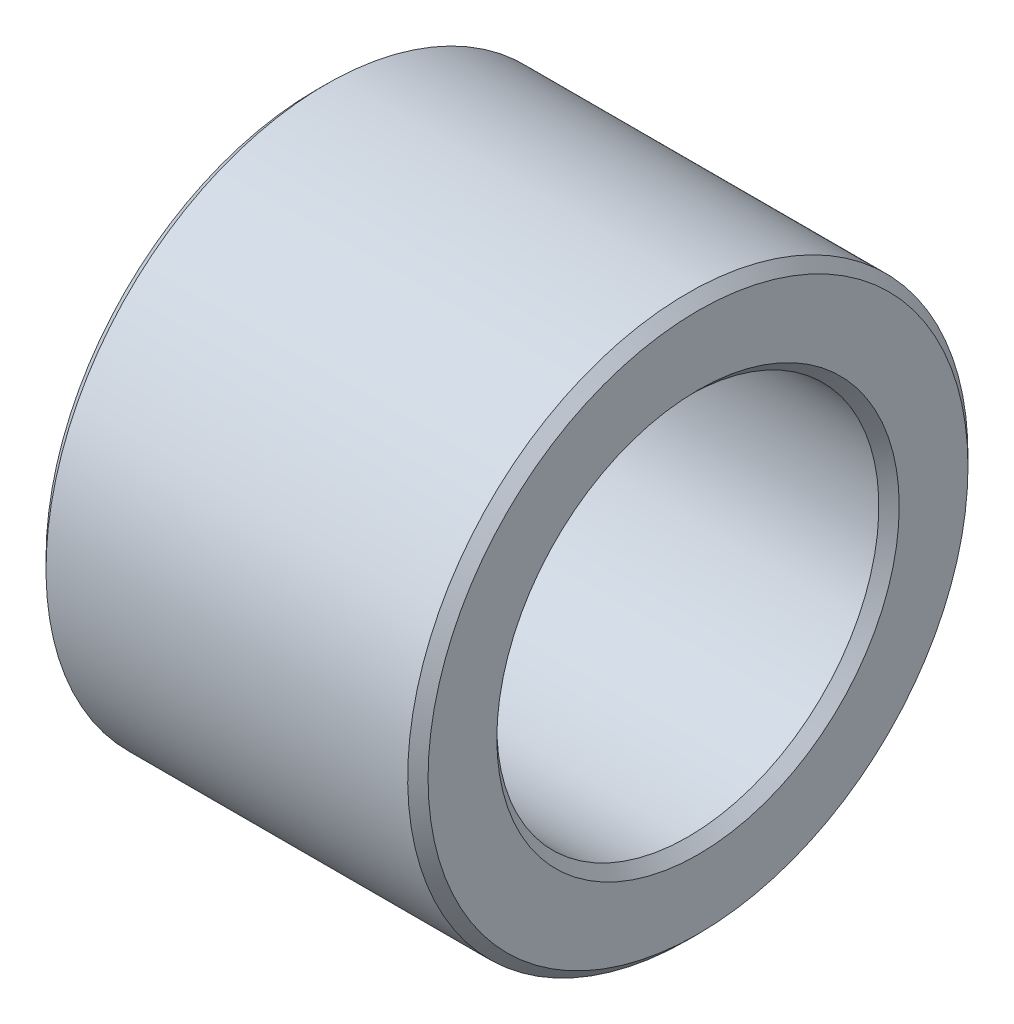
ISO-10303-21;
HEADER;
FILE_DESCRIPTION(('STEP AP214'),'2;1');
FILE_NAME('part.step','',(''),(''),'','','');
FILE_SCHEMA(('AUTOMOTIVE_DESIGN { 1 0 10303 214 1 1 1 1 }'));
ENDSEC;
DATA;
#1=APPLICATION_CONTEXT('core data for automotive mechanical design processes');
#2=APPLICATION_PROTOCOL_DEFINITION('international standard','automotive_design',2000,#1);
#3=PRODUCT_CONTEXT('',#1,'mechanical');
#4=PRODUCT('Part','Part','',(#3));
#5=PRODUCT_RELATED_PRODUCT_CATEGORY('part','',(#4));
#6=PRODUCT_DEFINITION_FORMATION('','',#4);
#7=PRODUCT_DEFINITION_CONTEXT('part definition',#1,'design');
#8=PRODUCT_DEFINITION('design','',#6,#7);
#9=PRODUCT_DEFINITION_SHAPE('','',#8);
#10=(LENGTH_UNIT() NAMED_UNIT(*) SI_UNIT(.MILLI.,.METRE.));
#11=(NAMED_UNIT(*) PLANE_ANGLE_UNIT() SI_UNIT($,.RADIAN.));
#12=(NAMED_UNIT(*) SI_UNIT($,.STERADIAN.) SOLID_ANGLE_UNIT());
#13=UNCERTAINTY_MEASURE_WITH_UNIT(LENGTH_MEASURE(1.E-05),#10,'distance_accuracy_value','');
#14=(GEOMETRIC_REPRESENTATION_CONTEXT(3) GLOBAL_UNCERTAINTY_ASSIGNED_CONTEXT((#13)) GLOBAL_UNIT_ASSIGNED_CONTEXT((#10,
#11,#12)) REPRESENTATION_CONTEXT('',''));
#15=CARTESIAN_POINT('',(0.,0.,0.));
#16=DIRECTION('',(0.,0.,1.));
#17=DIRECTION('',(1.,0.,0.));
#18=AXIS2_PLACEMENT_3D('',#15,#16,#17);
#19=CARTESIAN_POINT('',(0.,-9.25,0.));
#20=DIRECTION('',(-1.,0.,0.));
#21=DIRECTION('',(0.,1.,0.));
#22=AXIS2_PLACEMENT_3D('',#19,#20,#21);
#23=PLANE('',#22);
#24=CARTESIAN_POINT('',(0.,0.,0.));
#25=DIRECTION('',(1.,0.,0.));
#26=DIRECTION('',(0.,-1.,0.));
#27=AXIS2_PLACEMENT_3D('',#24,#25,#26);
#28=CIRCLE('',#27,7.9);
#29=CARTESIAN_POINT('',(0.,-7.9,0.));
#30=VERTEX_POINT('',#29);
#31=EDGE_CURVE('E9',#30,#30,#28,.T.);
#32=ORIENTED_EDGE('',*,*,#31,.T.);
#33=EDGE_LOOP('',(#32));
#34=FACE_BOUND('',#33,.T.);
#35=CARTESIAN_POINT('',(0.,0.,0.));
#36=DIRECTION('',(1.,0.,0.));
#37=DIRECTION('',(0.,-1.,0.));
#38=AXIS2_PLACEMENT_3D('',#35,#36,#37);
#39=CIRCLE('',#38,10.6);
#40=CARTESIAN_POINT('',(0.,-10.6,0.));
#41=VERTEX_POINT('',#40);
#42=EDGE_CURVE('E53',#41,#41,#39,.T.);
#43=ORIENTED_EDGE('',*,*,#42,.F.);
#44=EDGE_LOOP('',(#43));
#45=FACE_BOUND('',#44,.T.);
#46=ADVANCED_FACE('F15',(#34,#45),#23,.T.);
#47=CARTESIAN_POINT('',(0.2,0.,0.));
#48=DIRECTION('',(-1.,0.,0.));
#49=DIRECTION('',(0.,-1.,0.));
#50=AXIS2_PLACEMENT_3D('',#47,#48,#49);
#51=CONICAL_SURFACE('',#50,7.7,0.785398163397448);
#52=CARTESIAN_POINT('',(0.4,0.,0.));
#53=DIRECTION('',(1.,0.,0.));
#54=DIRECTION('',(0.,-1.,0.));
#55=AXIS2_PLACEMENT_3D('',#52,#53,#54);
#56=CIRCLE('',#55,7.5);
#57=CARTESIAN_POINT('',(0.4,-7.5,0.));
#58=VERTEX_POINT('',#57);
#59=EDGE_CURVE('E22',#58,#58,#56,.T.);
#60=ORIENTED_EDGE('',*,*,#59,.T.);
#61=EDGE_LOOP('',(#60));
#62=FACE_BOUND('',#61,.T.);
#63=ORIENTED_EDGE('',*,*,#31,.F.);
#64=EDGE_LOOP('',(#63));
#65=FACE_BOUND('',#64,.T.);
#66=ADVANCED_FACE('F82',(#62,#65),#51,.F.);
#67=CARTESIAN_POINT('',(7.5,0.,0.));
#68=DIRECTION('',(-1.,0.,0.));
#69=DIRECTION('',(0.,-1.,0.));
#70=AXIS2_PLACEMENT_3D('',#67,#68,#69);
#71=CYLINDRICAL_SURFACE('',#70,7.5);
#72=CARTESIAN_POINT('',(14.6,0.,0.));
#73=DIRECTION('',(1.,0.,0.));
#74=DIRECTION('',(0.,-1.,0.));
#75=AXIS2_PLACEMENT_3D('',#72,#73,#74);
#76=CIRCLE('',#75,7.5);
#77=CARTESIAN_POINT('',(14.6,-7.5,0.));
#78=VERTEX_POINT('',#77);
#79=EDGE_CURVE('E58',#78,#78,#76,.T.);
#80=ORIENTED_EDGE('',*,*,#79,.T.);
#81=EDGE_LOOP('',(#80));
#82=FACE_BOUND('',#81,.T.);
#83=ORIENTED_EDGE('',*,*,#59,.F.);
#84=EDGE_LOOP('',(#83));
#85=FACE_BOUND('',#84,.T.);
#86=ADVANCED_FACE('F66',(#82,#85),#71,.F.);
#87=CARTESIAN_POINT('',(14.8,0.,0.));
#88=DIRECTION('',(1.,0.,0.));
#89=DIRECTION('',(0.,-1.,0.));
#90=AXIS2_PLACEMENT_3D('',#87,#88,#89);
#91=CONICAL_SURFACE('',#90,7.7,0.785398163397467);
#92=CARTESIAN_POINT('',(15.,0.,0.));
#93=DIRECTION('',(1.,0.,0.));
#94=DIRECTION('',(0.,-1.,0.));
#95=AXIS2_PLACEMENT_3D('',#92,#93,#94);
#96=CIRCLE('',#95,7.9);
#97=CARTESIAN_POINT('',(15.,-7.9,0.));
#98=VERTEX_POINT('',#97);
#99=EDGE_CURVE('E63',#98,#98,#96,.T.);
#100=ORIENTED_EDGE('',*,*,#99,.T.);
#101=EDGE_LOOP('',(#100));
#102=FACE_BOUND('',#101,.T.);
#103=ORIENTED_EDGE('',*,*,#79,.F.);
#104=EDGE_LOOP('',(#103));
#105=FACE_BOUND('',#104,.T.);
#106=ADVANCED_FACE('F69',(#102,#105),#91,.F.);
#107=CARTESIAN_POINT('',(15.,-9.25,0.));
#108=DIRECTION('',(1.,0.,0.));
#109=DIRECTION('',(0.,-1.,0.));
#110=AXIS2_PLACEMENT_3D('',#107,#108,#109);
#111=PLANE('',#110);
#112=CARTESIAN_POINT('',(15.,0.,0.));
#113=DIRECTION('',(1.,0.,0.));
#114=DIRECTION('',(0.,-1.,0.));
#115=AXIS2_PLACEMENT_3D('',#112,#113,#114);
#116=CIRCLE('',#115,10.6);
#117=CARTESIAN_POINT('',(15.,-10.6,0.));
#118=VERTEX_POINT('',#117);
#119=EDGE_CURVE('E61',#118,#118,#116,.T.);
#120=ORIENTED_EDGE('',*,*,#119,.T.);
#121=EDGE_LOOP('',(#120));
#122=FACE_BOUND('',#121,.T.);
#123=ORIENTED_EDGE('',*,*,#99,.F.);
#124=EDGE_LOOP('',(#123));
#125=FACE_BOUND('',#124,.T.);
#126=ADVANCED_FACE('F71',(#122,#125),#111,.T.);
#127=CARTESIAN_POINT('',(14.8,0.,0.));
#128=DIRECTION('',(-1.,0.,0.));
#129=DIRECTION('',(0.,-1.,0.));
#130=AXIS2_PLACEMENT_3D('',#127,#128,#129);
#131=CONICAL_SURFACE('',#130,10.8,0.785398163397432);
#132=CARTESIAN_POINT('',(14.6,0.,0.));
#133=DIRECTION('',(1.,0.,0.));
#134=DIRECTION('',(0.,-1.,0.));
#135=AXIS2_PLACEMENT_3D('',#132,#133,#134);
#136=CIRCLE('',#135,11.);
#137=CARTESIAN_POINT('',(14.6,-11.,0.));
#138=VERTEX_POINT('',#137);
#139=EDGE_CURVE('E55',#138,#138,#136,.T.);
#140=ORIENTED_EDGE('',*,*,#139,.T.);
#141=EDGE_LOOP('',(#140));
#142=FACE_BOUND('',#141,.T.);
#143=ORIENTED_EDGE('',*,*,#119,.F.);
#144=EDGE_LOOP('',(#143));
#145=FACE_BOUND('',#144,.T.);
#146=ADVANCED_FACE('F79',(#142,#145),#131,.T.);
#147=CARTESIAN_POINT('',(7.5,0.,0.));
#148=DIRECTION('',(-1.,0.,0.));
#149=DIRECTION('',(0.,-1.,0.));
#150=AXIS2_PLACEMENT_3D('',#147,#148,#149);
#151=CYLINDRICAL_SURFACE('',#150,11.);
#152=CARTESIAN_POINT('',(0.4,0.,0.));
#153=DIRECTION('',(1.,0.,0.));
#154=DIRECTION('',(0.,-1.,0.));
#155=AXIS2_PLACEMENT_3D('',#152,#153,#154);
#156=CIRCLE('',#155,11.);
#157=CARTESIAN_POINT('',(0.4,-11.,0.));
#158=VERTEX_POINT('',#157);
#159=EDGE_CURVE('E49',#158,#158,#156,.T.);
#160=ORIENTED_EDGE('',*,*,#159,.T.);
#161=EDGE_LOOP('',(#160));
#162=FACE_BOUND('',#161,.T.);
#163=ORIENTED_EDGE('',*,*,#139,.F.);
#164=EDGE_LOOP('',(#163));
#165=FACE_BOUND('',#164,.T.);
#166=ADVANCED_FACE('F50',(#162,#165),#151,.T.);
#167=CARTESIAN_POINT('',(0.2,0.,0.));
#168=DIRECTION('',(1.,0.,0.));
#169=DIRECTION('',(0.,-1.,0.));
#170=AXIS2_PLACEMENT_3D('',#167,#168,#169);
#171=CONICAL_SURFACE('',#170,10.8,0.785398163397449);
#172=ORIENTED_EDGE('',*,*,#42,.T.);
#173=EDGE_LOOP('',(#172));
#174=FACE_BOUND('',#173,.T.);
#175=ORIENTED_EDGE('',*,*,#159,.F.);
#176=EDGE_LOOP('',(#175));
#177=FACE_BOUND('',#176,.T.);
#178=ADVANCED_FACE('F92',(#174,#177),#171,.T.);
#179=CLOSED_SHELL('',(#46,#66,#86,#106,#126,#146,#166,#178));
#180=MANIFOLD_SOLID_BREP('B1',#179);
#181=ADVANCED_BREP_SHAPE_REPRESENTATION('',(#18,#180),#14);
#182=SHAPE_DEFINITION_REPRESENTATION(#9,#181);
ENDSEC;
END-ISO-10303-21;
